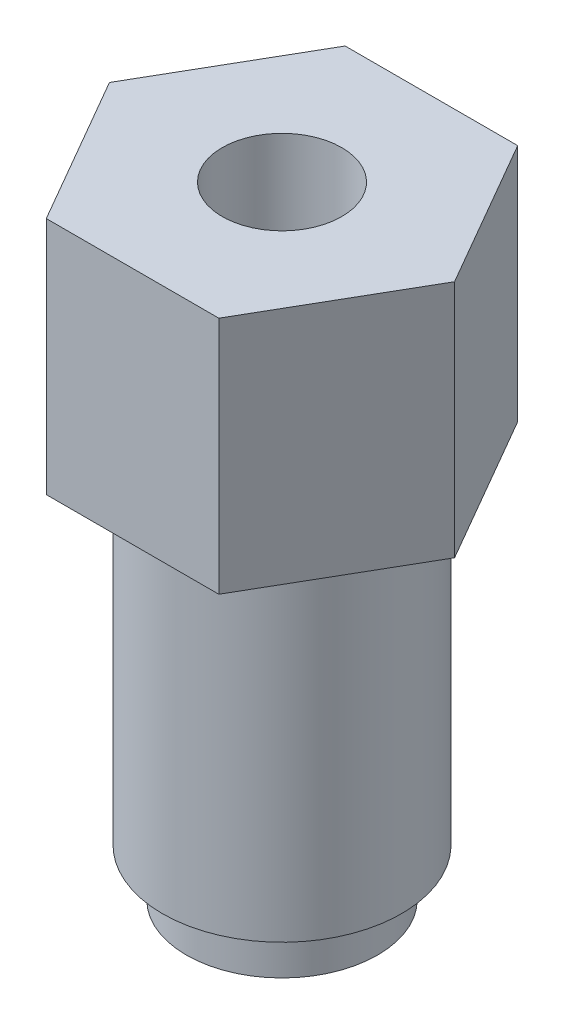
ISO-10303-21;
HEADER;
FILE_DESCRIPTION(('STEP AP214'),'2;1');
FILE_NAME('part.step','',(''),(''),'','','');
FILE_SCHEMA(('AUTOMOTIVE_DESIGN { 1 0 10303 214 1 1 1 1 }'));
ENDSEC;
DATA;
#1=APPLICATION_CONTEXT('core data for automotive mechanical design processes');
#2=APPLICATION_PROTOCOL_DEFINITION('international standard','automotive_design',2000,#1);
#3=PRODUCT_CONTEXT('',#1,'mechanical');
#4=PRODUCT('Part','Part','',(#3));
#5=PRODUCT_RELATED_PRODUCT_CATEGORY('part','',(#4));
#6=PRODUCT_DEFINITION_FORMATION('','',#4);
#7=PRODUCT_DEFINITION_CONTEXT('part definition',#1,'design');
#8=PRODUCT_DEFINITION('design','',#6,#7);
#9=PRODUCT_DEFINITION_SHAPE('','',#8);
#10=(LENGTH_UNIT() NAMED_UNIT(*) SI_UNIT(.MILLI.,.METRE.));
#11=(NAMED_UNIT(*) PLANE_ANGLE_UNIT() SI_UNIT($,.RADIAN.));
#12=(NAMED_UNIT(*) SI_UNIT($,.STERADIAN.) SOLID_ANGLE_UNIT());
#13=UNCERTAINTY_MEASURE_WITH_UNIT(LENGTH_MEASURE(1.E-05),#10,'distance_accuracy_value','');
#14=(GEOMETRIC_REPRESENTATION_CONTEXT(3) GLOBAL_UNCERTAINTY_ASSIGNED_CONTEXT((#13)) GLOBAL_UNIT_ASSIGNED_CONTEXT((#10,
#11,#12)) REPRESENTATION_CONTEXT('',''));
#15=CARTESIAN_POINT('',(0.,0.,0.));
#16=DIRECTION('',(0.,0.,1.));
#17=DIRECTION('',(1.,0.,0.));
#18=AXIS2_PLACEMENT_3D('',#15,#16,#17);
#19=CARTESIAN_POINT('',(-3.175,10.16,0.));
#20=DIRECTION('',(0.,1.,0.));
#21=DIRECTION('',(0.,0.,1.));
#22=AXIS2_PLACEMENT_3D('',#19,#20,#21);
#23=PLANE('',#22);
#24=CARTESIAN_POINT('',(0.,10.16,0.));
#25=DIRECTION('',(0.,-1.,0.));
#26=DIRECTION('',(0.,0.,-1.));
#27=AXIS2_PLACEMENT_3D('',#24,#25,#26);
#28=CIRCLE('',#27,3.175);
#29=CARTESIAN_POINT('',(0.,10.16,-3.175));
#30=VERTEX_POINT('',#29);
#31=EDGE_CURVE('E139',#30,#30,#28,.T.);
#32=ORIENTED_EDGE('',*,*,#31,.F.);
#33=EDGE_LOOP('',(#32));
#34=FACE_BOUND('',#33,.T.);
#35=DIRECTION('',(0.5,0.,-0.866025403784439));
#36=VECTOR('',#35,1.);
#37=CARTESIAN_POINT('',(2.64328832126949,10.16,3.3591903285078));
#38=LINE('',#37,#36);
#39=CARTESIAN_POINT('',(2.29135888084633,10.16,3.96875));
#40=VERTEX_POINT('',#39);
#41=CARTESIAN_POINT('',(4.58271776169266,10.16,0.));
#42=VERTEX_POINT('',#41);
#43=EDGE_CURVE('E134',#40,#42,#38,.T.);
#44=ORIENTED_EDGE('',*,*,#43,.F.);
#45=DIRECTION('',(1.,0.,0.));
#46=VECTOR('',#45,1.);
#47=CARTESIAN_POINT('',(-3.175,10.16,3.96875));
#48=LINE('',#47,#46);
#49=CARTESIAN_POINT('',(-2.29135888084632,10.16,3.96875));
#50=VERTEX_POINT('',#49);
#51=EDGE_CURVE('E132',#50,#40,#48,.T.);
#52=ORIENTED_EDGE('',*,*,#51,.F.);
#53=DIRECTION('',(0.5,0.,0.866025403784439));
#54=VECTOR('',#53,1.);
#55=CARTESIAN_POINT('',(-4.23078832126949,10.16,0.609559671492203));
#56=LINE('',#55,#54);
#57=CARTESIAN_POINT('',(-4.58271776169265,10.16,0.));
#58=VERTEX_POINT('',#57);
#59=EDGE_CURVE('E130',#58,#50,#56,.T.);
#60=ORIENTED_EDGE('',*,*,#59,.F.);
#61=DIRECTION('',(-0.5,0.,0.866025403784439));
#62=VECTOR('',#61,1.);
#63=CARTESIAN_POINT('',(-4.23078832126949,10.16,-0.609559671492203));
#64=LINE('',#63,#62);
#65=CARTESIAN_POINT('',(-2.29135888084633,10.16,-3.96875));
#66=VERTEX_POINT('',#65);
#67=EDGE_CURVE('E128',#66,#58,#64,.T.);
#68=ORIENTED_EDGE('',*,*,#67,.F.);
#69=DIRECTION('',(-1.,0.,0.));
#70=VECTOR('',#69,1.);
#71=CARTESIAN_POINT('',(-3.175,10.16,-3.96875));
#72=LINE('',#71,#70);
#73=CARTESIAN_POINT('',(2.29135888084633,10.16,-3.96875));
#74=VERTEX_POINT('',#73);
#75=EDGE_CURVE('E90',#74,#66,#72,.T.);
#76=ORIENTED_EDGE('',*,*,#75,.F.);
#77=DIRECTION('',(-0.5,0.,-0.866025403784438));
#78=VECTOR('',#77,1.);
#79=CARTESIAN_POINT('',(2.64328832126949,10.16,-3.3591903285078));
#80=LINE('',#79,#78);
#81=EDGE_CURVE('E120',#42,#74,#80,.T.);
#82=ORIENTED_EDGE('',*,*,#81,.F.);
#83=EDGE_LOOP('',(#44,#52,#60,#68,#76,#82));
#84=FACE_BOUND('',#83,.T.);
#85=ADVANCED_FACE('F34',(#34,#84),#23,.F.);
#86=CARTESIAN_POINT('',(-4.7625,16.51,0.));
#87=DIRECTION('',(0.,-1.,0.));
#88=DIRECTION('',(0.,0.,-1.));
#89=AXIS2_PLACEMENT_3D('',#86,#87,#88);
#90=PLANE('',#89);
#91=CARTESIAN_POINT('',(0.,16.51,0.));
#92=DIRECTION('',(0.,-1.,0.));
#93=DIRECTION('',(0.,0.,-1.));
#94=AXIS2_PLACEMENT_3D('',#91,#92,#93);
#95=CIRCLE('',#94,1.5875);
#96=CARTESIAN_POINT('',(0.,16.51,-1.5875));
#97=VERTEX_POINT('',#96);
#98=EDGE_CURVE('E136',#97,#97,#95,.T.);
#99=ORIENTED_EDGE('',*,*,#98,.T.);
#100=EDGE_LOOP('',(#99));
#101=FACE_BOUND('',#100,.T.);
#102=DIRECTION('',(0.5,0.,-0.866025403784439));
#103=VECTOR('',#102,1.);
#104=CARTESIAN_POINT('',(2.29135888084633,16.51,3.96875));
#105=LINE('',#104,#103);
#106=CARTESIAN_POINT('',(2.29135888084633,16.51,3.96875));
#107=VERTEX_POINT('',#106);
#108=CARTESIAN_POINT('',(4.58271776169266,16.51,0.));
#109=VERTEX_POINT('',#108);
#110=EDGE_CURVE('E110',#107,#109,#105,.T.);
#111=ORIENTED_EDGE('',*,*,#110,.T.);
#112=DIRECTION('',(-0.5,0.,-0.866025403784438));
#113=VECTOR('',#112,1.);
#114=CARTESIAN_POINT('',(4.58271776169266,16.51,0.));
#115=LINE('',#114,#113);
#116=CARTESIAN_POINT('',(2.29135888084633,16.51,-3.96875));
#117=VERTEX_POINT('',#116);
#118=EDGE_CURVE('E108',#109,#117,#115,.T.);
#119=ORIENTED_EDGE('',*,*,#118,.T.);
#120=DIRECTION('',(-1.,0.,0.));
#121=VECTOR('',#120,1.);
#122=CARTESIAN_POINT('',(2.29135888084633,16.51,-3.96875));
#123=LINE('',#122,#121);
#124=CARTESIAN_POINT('',(-2.29135888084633,16.51,-3.96875));
#125=VERTEX_POINT('',#124);
#126=EDGE_CURVE('E57',#117,#125,#123,.T.);
#127=ORIENTED_EDGE('',*,*,#126,.T.);
#128=DIRECTION('',(-0.5,0.,0.866025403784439));
#129=VECTOR('',#128,1.);
#130=CARTESIAN_POINT('',(-2.29135888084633,16.51,-3.96875));
#131=LINE('',#130,#129);
#132=CARTESIAN_POINT('',(-4.58271776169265,16.51,0.));
#133=VERTEX_POINT('',#132);
#134=EDGE_CURVE('E97',#125,#133,#131,.T.);
#135=ORIENTED_EDGE('',*,*,#134,.T.);
#136=DIRECTION('',(0.5,0.,0.866025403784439));
#137=VECTOR('',#136,1.);
#138=CARTESIAN_POINT('',(-4.58271776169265,16.51,0.));
#139=LINE('',#138,#137);
#140=CARTESIAN_POINT('',(-2.29135888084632,16.51,3.96875));
#141=VERTEX_POINT('',#140);
#142=EDGE_CURVE('E103',#133,#141,#139,.T.);
#143=ORIENTED_EDGE('',*,*,#142,.T.);
#144=DIRECTION('',(1.,0.,0.));
#145=VECTOR('',#144,1.);
#146=CARTESIAN_POINT('',(-2.29135888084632,16.51,3.96875));
#147=LINE('',#146,#145);
#148=EDGE_CURVE('E115',#141,#107,#147,.T.);
#149=ORIENTED_EDGE('',*,*,#148,.T.);
#150=EDGE_LOOP('',(#111,#119,#127,#135,#143,#149));
#151=FACE_BOUND('',#150,.T.);
#152=ADVANCED_FACE('F107',(#101,#151),#90,.F.);
#153=CARTESIAN_POINT('',(0.,0.,0.));
#154=DIRECTION('',(0.,-1.,0.));
#155=DIRECTION('',(0.,0.,-1.));
#156=AXIS2_PLACEMENT_3D('',#153,#154,#155);
#157=CYLINDRICAL_SURFACE('',#156,1.5875);
#158=ORIENTED_EDGE('',*,*,#98,.F.);
#159=EDGE_LOOP('',(#158));
#160=FACE_BOUND('',#159,.T.);
#161=CARTESIAN_POINT('',(0.,0.,0.));
#162=DIRECTION('',(0.,-1.,0.));
#163=DIRECTION('',(0.,0.,-1.));
#164=AXIS2_PLACEMENT_3D('',#161,#162,#163);
#165=CIRCLE('',#164,1.5875);
#166=CARTESIAN_POINT('',(0.,0.,-1.5875));
#167=VERTEX_POINT('',#166);
#168=EDGE_CURVE('E12',#167,#167,#165,.T.);
#169=ORIENTED_EDGE('',*,*,#168,.T.);
#170=EDGE_LOOP('',(#169));
#171=FACE_BOUND('',#170,.T.);
#172=ADVANCED_FACE('F36',(#160,#171),#157,.F.);
#173=CARTESIAN_POINT('',(-1.5875,0.,0.));
#174=DIRECTION('',(0.,1.,0.));
#175=DIRECTION('',(0.,0.,1.));
#176=AXIS2_PLACEMENT_3D('',#173,#174,#175);
#177=PLANE('',#176);
#178=ORIENTED_EDGE('',*,*,#168,.F.);
#179=EDGE_LOOP('',(#178));
#180=FACE_BOUND('',#179,.T.);
#181=CARTESIAN_POINT('',(0.,0.,0.));
#182=DIRECTION('',(0.,-1.,0.));
#183=DIRECTION('',(0.,0.,-1.));
#184=AXIS2_PLACEMENT_3D('',#181,#182,#183);
#185=CIRCLE('',#184,2.54);
#186=CARTESIAN_POINT('',(0.,0.,-2.54));
#187=VERTEX_POINT('',#186);
#188=EDGE_CURVE('E42',#187,#187,#185,.T.);
#189=ORIENTED_EDGE('',*,*,#188,.T.);
#190=EDGE_LOOP('',(#189));
#191=FACE_BOUND('',#190,.T.);
#192=ADVANCED_FACE('F150',(#180,#191),#177,.F.);
#193=CARTESIAN_POINT('',(0.,0.,0.));
#194=DIRECTION('',(0.,-1.,0.));
#195=DIRECTION('',(0.,0.,-1.));
#196=AXIS2_PLACEMENT_3D('',#193,#194,#195);
#197=CYLINDRICAL_SURFACE('',#196,2.54);
#198=ORIENTED_EDGE('',*,*,#188,.F.);
#199=EDGE_LOOP('',(#198));
#200=FACE_BOUND('',#199,.T.);
#201=CARTESIAN_POINT('',(0.,1.27,0.));
#202=DIRECTION('',(0.,-1.,0.));
#203=DIRECTION('',(0.,0.,-1.));
#204=AXIS2_PLACEMENT_3D('',#201,#202,#203);
#205=CIRCLE('',#204,2.54);
#206=CARTESIAN_POINT('',(0.,1.27,-2.54));
#207=VERTEX_POINT('',#206);
#208=EDGE_CURVE('E145',#207,#207,#205,.T.);
#209=ORIENTED_EDGE('',*,*,#208,.T.);
#210=EDGE_LOOP('',(#209));
#211=FACE_BOUND('',#210,.T.);
#212=ADVANCED_FACE('F152',(#200,#211),#197,.T.);
#213=CARTESIAN_POINT('',(-2.54,1.27,0.));
#214=DIRECTION('',(0.,1.,0.));
#215=DIRECTION('',(0.,0.,1.));
#216=AXIS2_PLACEMENT_3D('',#213,#214,#215);
#217=PLANE('',#216);
#218=ORIENTED_EDGE('',*,*,#208,.F.);
#219=EDGE_LOOP('',(#218));
#220=FACE_BOUND('',#219,.T.);
#221=CARTESIAN_POINT('',(0.,1.27,0.));
#222=DIRECTION('',(0.,-1.,0.));
#223=DIRECTION('',(0.,0.,-1.));
#224=AXIS2_PLACEMENT_3D('',#221,#222,#223);
#225=CIRCLE('',#224,3.175);
#226=CARTESIAN_POINT('',(0.,1.27,-3.175));
#227=VERTEX_POINT('',#226);
#228=EDGE_CURVE('E142',#227,#227,#225,.T.);
#229=ORIENTED_EDGE('',*,*,#228,.T.);
#230=EDGE_LOOP('',(#229));
#231=FACE_BOUND('',#230,.T.);
#232=ADVANCED_FACE('F155',(#220,#231),#217,.F.);
#233=CARTESIAN_POINT('',(0.,0.,0.));
#234=DIRECTION('',(0.,-1.,0.));
#235=DIRECTION('',(0.,0.,-1.));
#236=AXIS2_PLACEMENT_3D('',#233,#234,#235);
#237=CYLINDRICAL_SURFACE('',#236,3.175);
#238=ORIENTED_EDGE('',*,*,#228,.F.);
#239=EDGE_LOOP('',(#238));
#240=FACE_BOUND('',#239,.T.);
#241=ORIENTED_EDGE('',*,*,#31,.T.);
#242=EDGE_LOOP('',(#241));
#243=FACE_BOUND('',#242,.T.);
#244=ADVANCED_FACE('F161',(#240,#243),#237,.T.);
#245=CARTESIAN_POINT('',(2.29135888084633,0.,3.96875));
#246=DIRECTION('',(0.866025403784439,0.,0.5));
#247=DIRECTION('',(0.5,0.,-0.866025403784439));
#248=AXIS2_PLACEMENT_3D('',#245,#246,#247);
#249=PLANE('',#248);
#250=ORIENTED_EDGE('',*,*,#43,.T.);
#251=DIRECTION('',(0.,1.,0.));
#252=VECTOR('',#251,1.);
#253=CARTESIAN_POINT('',(4.58271776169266,0.,0.));
#254=LINE('',#253,#252);
#255=EDGE_CURVE('E49',#42,#109,#254,.T.);
#256=ORIENTED_EDGE('',*,*,#255,.T.);
#257=ORIENTED_EDGE('',*,*,#110,.F.);
#258=DIRECTION('',(0.,1.,0.));
#259=VECTOR('',#258,1.);
#260=CARTESIAN_POINT('',(2.29135888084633,0.,3.96875));
#261=LINE('',#260,#259);
#262=EDGE_CURVE('E118',#40,#107,#261,.T.);
#263=ORIENTED_EDGE('',*,*,#262,.F.);
#264=EDGE_LOOP('',(#250,#256,#257,#263));
#265=FACE_BOUND('',#264,.T.);
#266=ADVANCED_FACE('F167',(#265),#249,.T.);
#267=CARTESIAN_POINT('',(-2.29135888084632,0.,3.96875));
#268=DIRECTION('',(0.,0.,1.));
#269=DIRECTION('',(1.,0.,0.));
#270=AXIS2_PLACEMENT_3D('',#267,#268,#269);
#271=PLANE('',#270);
#272=ORIENTED_EDGE('',*,*,#51,.T.);
#273=ORIENTED_EDGE('',*,*,#262,.T.);
#274=ORIENTED_EDGE('',*,*,#148,.F.);
#275=DIRECTION('',(0.,1.,0.));
#276=VECTOR('',#275,1.);
#277=CARTESIAN_POINT('',(-2.29135888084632,0.,3.96875));
#278=LINE('',#277,#276);
#279=EDGE_CURVE('E121',#50,#141,#278,.T.);
#280=ORIENTED_EDGE('',*,*,#279,.F.);
#281=EDGE_LOOP('',(#272,#273,#274,#280));
#282=FACE_BOUND('',#281,.T.);
#283=ADVANCED_FACE('F183',(#282),#271,.T.);
#284=CARTESIAN_POINT('',(-4.58271776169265,0.,0.));
#285=DIRECTION('',(-0.866025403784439,0.,0.5));
#286=DIRECTION('',(0.5,0.,0.866025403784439));
#287=AXIS2_PLACEMENT_3D('',#284,#285,#286);
#288=PLANE('',#287);
#289=ORIENTED_EDGE('',*,*,#59,.T.);
#290=ORIENTED_EDGE('',*,*,#279,.T.);
#291=ORIENTED_EDGE('',*,*,#142,.F.);
#292=DIRECTION('',(0.,1.,0.));
#293=VECTOR('',#292,1.);
#294=CARTESIAN_POINT('',(-4.58271776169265,0.,0.));
#295=LINE('',#294,#293);
#296=EDGE_CURVE('E93',#58,#133,#295,.T.);
#297=ORIENTED_EDGE('',*,*,#296,.F.);
#298=EDGE_LOOP('',(#289,#290,#291,#297));
#299=FACE_BOUND('',#298,.T.);
#300=ADVANCED_FACE('F186',(#299),#288,.T.);
#301=CARTESIAN_POINT('',(-2.29135888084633,0.,-3.96875));
#302=DIRECTION('',(-0.866025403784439,0.,-0.5));
#303=DIRECTION('',(-0.5,0.,0.866025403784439));
#304=AXIS2_PLACEMENT_3D('',#301,#302,#303);
#305=PLANE('',#304);
#306=ORIENTED_EDGE('',*,*,#67,.T.);
#307=ORIENTED_EDGE('',*,*,#296,.T.);
#308=ORIENTED_EDGE('',*,*,#134,.F.);
#309=DIRECTION('',(0.,1.,0.));
#310=VECTOR('',#309,1.);
#311=CARTESIAN_POINT('',(-2.29135888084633,0.,-3.96875));
#312=LINE('',#311,#310);
#313=EDGE_CURVE('E86',#66,#125,#312,.T.);
#314=ORIENTED_EDGE('',*,*,#313,.F.);
#315=EDGE_LOOP('',(#306,#307,#308,#314));
#316=FACE_BOUND('',#315,.T.);
#317=ADVANCED_FACE('F98',(#316),#305,.T.);
#318=CARTESIAN_POINT('',(2.29135888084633,0.,-3.96875));
#319=DIRECTION('',(0.,0.,-1.));
#320=DIRECTION('',(-1.,0.,0.));
#321=AXIS2_PLACEMENT_3D('',#318,#319,#320);
#322=PLANE('',#321);
#323=ORIENTED_EDGE('',*,*,#75,.T.);
#324=ORIENTED_EDGE('',*,*,#313,.T.);
#325=ORIENTED_EDGE('',*,*,#126,.F.);
#326=DIRECTION('',(0.,1.,0.));
#327=VECTOR('',#326,1.);
#328=CARTESIAN_POINT('',(2.29135888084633,0.,-3.96875));
#329=LINE('',#328,#327);
#330=EDGE_CURVE('E94',#74,#117,#329,.T.);
#331=ORIENTED_EDGE('',*,*,#330,.F.);
#332=EDGE_LOOP('',(#323,#324,#325,#331));
#333=FACE_BOUND('',#332,.T.);
#334=ADVANCED_FACE('F88',(#333),#322,.T.);
#335=CARTESIAN_POINT('',(4.58271776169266,0.,0.));
#336=DIRECTION('',(0.866025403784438,0.,-0.5));
#337=DIRECTION('',(-0.5,0.,-0.866025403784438));
#338=AXIS2_PLACEMENT_3D('',#335,#336,#337);
#339=PLANE('',#338);
#340=ORIENTED_EDGE('',*,*,#81,.T.);
#341=ORIENTED_EDGE('',*,*,#330,.T.);
#342=ORIENTED_EDGE('',*,*,#118,.F.);
#343=ORIENTED_EDGE('',*,*,#255,.F.);
#344=EDGE_LOOP('',(#340,#341,#342,#343));
#345=FACE_BOUND('',#344,.T.);
#346=ADVANCED_FACE('F198',(#345),#339,.T.);
#347=CLOSED_SHELL('',(#85,#152,#172,#192,#212,#232,#244,#266,#283,#300,#317,#334,#346));
#348=MANIFOLD_SOLID_BREP('B2',#347);
#349=ADVANCED_BREP_SHAPE_REPRESENTATION('',(#18,#348),#14);
#350=SHAPE_DEFINITION_REPRESENTATION(#9,#349);
ENDSEC;
END-ISO-10303-21;
